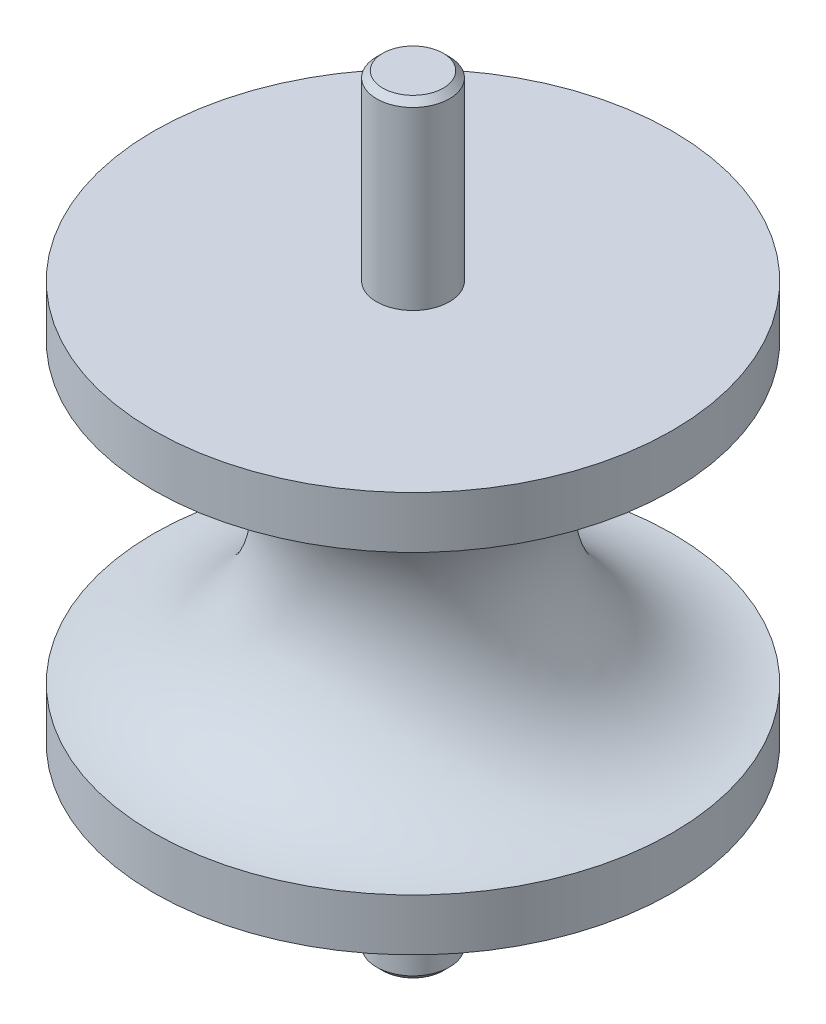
ISO-10303-21;
HEADER;
FILE_DESCRIPTION(('STEP AP214'),'2;1');
FILE_NAME('part.step','',(''),(''),'','','');
FILE_SCHEMA(('AUTOMOTIVE_DESIGN { 1 0 10303 214 1 1 1 1 }'));
ENDSEC;
DATA;
#1=APPLICATION_CONTEXT('core data for automotive mechanical design processes');
#2=APPLICATION_PROTOCOL_DEFINITION('international standard','automotive_design',2000,#1);
#3=PRODUCT_CONTEXT('',#1,'mechanical');
#4=PRODUCT('Part','Part','',(#3));
#5=PRODUCT_RELATED_PRODUCT_CATEGORY('part','',(#4));
#6=PRODUCT_DEFINITION_FORMATION('','',#4);
#7=PRODUCT_DEFINITION_CONTEXT('part definition',#1,'design');
#8=PRODUCT_DEFINITION('design','',#6,#7);
#9=PRODUCT_DEFINITION_SHAPE('','',#8);
#10=(LENGTH_UNIT() NAMED_UNIT(*) SI_UNIT(.MILLI.,.METRE.));
#11=(NAMED_UNIT(*) PLANE_ANGLE_UNIT() SI_UNIT($,.RADIAN.));
#12=(NAMED_UNIT(*) SI_UNIT($,.STERADIAN.) SOLID_ANGLE_UNIT());
#13=UNCERTAINTY_MEASURE_WITH_UNIT(LENGTH_MEASURE(1.E-05),#10,'distance_accuracy_value','');
#14=(GEOMETRIC_REPRESENTATION_CONTEXT(3) GLOBAL_UNCERTAINTY_ASSIGNED_CONTEXT((#13)) GLOBAL_UNIT_ASSIGNED_CONTEXT((#10,
#11,#12)) REPRESENTATION_CONTEXT('',''));
#15=CARTESIAN_POINT('',(0.,0.,0.));
#16=DIRECTION('',(0.,0.,1.));
#17=DIRECTION('',(1.,0.,0.));
#18=AXIS2_PLACEMENT_3D('',#15,#16,#17);
#19=CARTESIAN_POINT('',(28.5,22.,0.));
#20=DIRECTION('',(0.,1.,0.));
#21=DIRECTION('',(0.,0.,1.));
#22=AXIS2_PLACEMENT_3D('',#19,#20,#21);
#23=PLANE('',#22);
#24=CARTESIAN_POINT('',(0.,22.,0.));
#25=DIRECTION('',(0.,-1.,0.));
#26=DIRECTION('',(0.,0.,-1.));
#27=AXIS2_PLACEMENT_3D('',#24,#25,#26);
#28=CIRCLE('',#27,4.);
#29=CARTESIAN_POINT('',(0.,22.,-4.));
#30=VERTEX_POINT('',#29);
#31=EDGE_CURVE('E9',#30,#30,#28,.T.);
#32=ORIENTED_EDGE('',*,*,#31,.T.);
#33=EDGE_LOOP('',(#32));
#34=FACE_BOUND('',#33,.T.);
#35=CARTESIAN_POINT('',(0.,22.,0.));
#36=DIRECTION('',(0.,-1.,0.));
#37=DIRECTION('',(0.,0.,-1.));
#38=AXIS2_PLACEMENT_3D('',#35,#36,#37);
#39=CIRCLE('',#38,28.5);
#40=CARTESIAN_POINT('',(0.,22.,-28.5));
#41=VERTEX_POINT('',#40);
#42=EDGE_CURVE('E63',#41,#41,#39,.T.);
#43=ORIENTED_EDGE('',*,*,#42,.F.);
#44=EDGE_LOOP('',(#43));
#45=FACE_BOUND('',#44,.T.);
#46=ADVANCED_FACE('F13',(#34,#45),#23,.T.);
#47=CARTESIAN_POINT('',(0.,42.,0.));
#48=DIRECTION('',(0.,-1.,0.));
#49=DIRECTION('',(0.,0.,-1.));
#50=AXIS2_PLACEMENT_3D('',#47,#48,#49);
#51=CYLINDRICAL_SURFACE('',#50,4.);
#52=CARTESIAN_POINT('',(0.,41.3234375,0.));
#53=DIRECTION('',(0.,-1.,0.));
#54=DIRECTION('',(0.,0.,-1.));
#55=AXIS2_PLACEMENT_3D('',#52,#53,#54);
#56=CIRCLE('',#55,4.);
#57=CARTESIAN_POINT('',(0.,41.3234375,-4.));
#58=VERTEX_POINT('',#57);
#59=EDGE_CURVE('E20',#58,#58,#56,.T.);
#60=ORIENTED_EDGE('',*,*,#59,.T.);
#61=EDGE_LOOP('',(#60));
#62=FACE_BOUND('',#61,.T.);
#63=ORIENTED_EDGE('',*,*,#31,.F.);
#64=EDGE_LOOP('',(#63));
#65=FACE_BOUND('',#64,.T.);
#66=ADVANCED_FACE('F71',(#62,#65),#51,.T.);
#67=CARTESIAN_POINT('',(0.,41.3234375,0.));
#68=DIRECTION('',(0.,-1.,0.));
#69=DIRECTION('',(0.,0.,-1.));
#70=AXIS2_PLACEMENT_3D('',#67,#68,#69);
#71=CONICAL_SURFACE('',#70,4.,0.785398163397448);
#72=CARTESIAN_POINT('',(0.,42.,0.));
#73=DIRECTION('',(0.,-1.,0.));
#74=DIRECTION('',(0.,0.,-1.));
#75=AXIS2_PLACEMENT_3D('',#72,#73,#74);
#76=CIRCLE('',#75,3.3234375);
#77=CARTESIAN_POINT('',(0.,42.,-3.3234375));
#78=VERTEX_POINT('',#77);
#79=EDGE_CURVE('E29',#78,#78,#76,.T.);
#80=ORIENTED_EDGE('',*,*,#79,.T.);
#81=EDGE_LOOP('',(#80));
#82=FACE_BOUND('',#81,.T.);
#83=ORIENTED_EDGE('',*,*,#59,.F.);
#84=EDGE_LOOP('',(#83));
#85=FACE_BOUND('',#84,.T.);
#86=ADVANCED_FACE('F77',(#82,#85),#71,.T.);
#87=CARTESIAN_POINT('',(0.,42.,0.));
#88=DIRECTION('',(0.,-1.,0.));
#89=DIRECTION('',(0.,0.,-1.));
#90=AXIS2_PLACEMENT_3D('',#87,#88,#89);
#91=PLANE('',#90);
#92=ORIENTED_EDGE('',*,*,#79,.F.);
#93=EDGE_LOOP('',(#92));
#94=FACE_BOUND('',#93,.T.);
#95=ADVANCED_FACE('F82',(#94),#91,.F.);
#96=CARTESIAN_POINT('',(0.,-42.,0.));
#97=DIRECTION('',(0.,-1.,0.));
#98=DIRECTION('',(0.,0.,-1.));
#99=AXIS2_PLACEMENT_3D('',#96,#97,#98);
#100=PLANE('',#99);
#101=CARTESIAN_POINT('',(0.,-42.,0.));
#102=DIRECTION('',(0.,-1.,0.));
#103=DIRECTION('',(0.,0.,-1.));
#104=AXIS2_PLACEMENT_3D('',#101,#102,#103);
#105=CIRCLE('',#104,3.32343750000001);
#106=CARTESIAN_POINT('',(0.,-42.,-3.32343750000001));
#107=VERTEX_POINT('',#106);
#108=EDGE_CURVE('E37',#107,#107,#105,.T.);
#109=ORIENTED_EDGE('',*,*,#108,.T.);
#110=EDGE_LOOP('',(#109));
#111=FACE_BOUND('',#110,.T.);
#112=ADVANCED_FACE('F89',(#111),#100,.T.);
#113=CARTESIAN_POINT('',(0.,-41.3234375,0.));
#114=DIRECTION('',(0.,1.,0.));
#115=DIRECTION('',(0.,0.,1.));
#116=AXIS2_PLACEMENT_3D('',#113,#114,#115);
#117=CONICAL_SURFACE('',#116,4.,0.785398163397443);
#118=ORIENTED_EDGE('',*,*,#108,.F.);
#119=EDGE_LOOP('',(#118));
#120=FACE_BOUND('',#119,.T.);
#121=CARTESIAN_POINT('',(0.,-41.3234375,0.));
#122=DIRECTION('',(0.,-1.,0.));
#123=DIRECTION('',(0.,0.,-1.));
#124=AXIS2_PLACEMENT_3D('',#121,#122,#123);
#125=CIRCLE('',#124,4.);
#126=CARTESIAN_POINT('',(0.,-41.3234375,-4.));
#127=VERTEX_POINT('',#126);
#128=EDGE_CURVE('E43',#127,#127,#125,.T.);
#129=ORIENTED_EDGE('',*,*,#128,.T.);
#130=EDGE_LOOP('',(#129));
#131=FACE_BOUND('',#130,.T.);
#132=ADVANCED_FACE('F93',(#120,#131),#117,.T.);
#133=CARTESIAN_POINT('',(0.,42.,0.));
#134=DIRECTION('',(0.,-1.,0.));
#135=DIRECTION('',(0.,0.,-1.));
#136=AXIS2_PLACEMENT_3D('',#133,#134,#135);
#137=CYLINDRICAL_SURFACE('',#136,4.);
#138=ORIENTED_EDGE('',*,*,#128,.F.);
#139=EDGE_LOOP('',(#138));
#140=FACE_BOUND('',#139,.T.);
#141=CARTESIAN_POINT('',(0.,-22.,0.));
#142=DIRECTION('',(0.,-1.,0.));
#143=DIRECTION('',(0.,0.,-1.));
#144=AXIS2_PLACEMENT_3D('',#141,#142,#143);
#145=CIRCLE('',#144,4.);
#146=CARTESIAN_POINT('',(0.,-22.,-4.));
#147=VERTEX_POINT('',#146);
#148=EDGE_CURVE('E47',#147,#147,#145,.T.);
#149=ORIENTED_EDGE('',*,*,#148,.T.);
#150=EDGE_LOOP('',(#149));
#151=FACE_BOUND('',#150,.T.);
#152=ADVANCED_FACE('F97',(#140,#151),#137,.T.);
#153=CARTESIAN_POINT('',(28.5,-22.,0.));
#154=DIRECTION('',(0.,1.,0.));
#155=DIRECTION('',(0.,0.,1.));
#156=AXIS2_PLACEMENT_3D('',#153,#154,#155);
#157=PLANE('',#156);
#158=ORIENTED_EDGE('',*,*,#148,.F.);
#159=EDGE_LOOP('',(#158));
#160=FACE_BOUND('',#159,.T.);
#161=CARTESIAN_POINT('',(0.,-22.,0.));
#162=DIRECTION('',(0.,-1.,0.));
#163=DIRECTION('',(0.,0.,-1.));
#164=AXIS2_PLACEMENT_3D('',#161,#162,#163);
#165=CIRCLE('',#164,28.5);
#166=CARTESIAN_POINT('',(0.,-22.,-28.5));
#167=VERTEX_POINT('',#166);
#168=EDGE_CURVE('E51',#167,#167,#165,.T.);
#169=ORIENTED_EDGE('',*,*,#168,.T.);
#170=EDGE_LOOP('',(#169));
#171=FACE_BOUND('',#170,.T.);
#172=ADVANCED_FACE('F101',(#160,#171),#157,.F.);
#173=CARTESIAN_POINT('',(0.,42.,0.));
#174=DIRECTION('',(0.,-1.,0.));
#175=DIRECTION('',(0.,0.,-1.));
#176=AXIS2_PLACEMENT_3D('',#173,#174,#175);
#177=CYLINDRICAL_SURFACE('',#176,28.5);
#178=CARTESIAN_POINT('',(0.,-16.3,0.));
#179=DIRECTION('',(0.,-1.,0.));
#180=DIRECTION('',(0.,0.,-1.));
#181=AXIS2_PLACEMENT_3D('',#178,#179,#180);
#182=CIRCLE('',#181,28.5);
#183=CARTESIAN_POINT('',(0.,-16.3,-28.5));
#184=VERTEX_POINT('',#183);
#185=EDGE_CURVE('E55',#184,#184,#182,.T.);
#186=ORIENTED_EDGE('',*,*,#185,.T.);
#187=EDGE_LOOP('',(#186));
#188=FACE_BOUND('',#187,.T.);
#189=ORIENTED_EDGE('',*,*,#168,.F.);
#190=EDGE_LOOP('',(#189));
#191=FACE_BOUND('',#190,.T.);
#192=ADVANCED_FACE('F105',(#188,#191),#177,.T.);
#193=CARTESIAN_POINT('',(0.,0.,0.));
#194=DIRECTION('',(0.,-1.,0.));
#195=DIRECTION('',(0.,0.,-1.));
#196=AXIS2_PLACEMENT_3D('',#193,#194,#195);
#197=TOROIDAL_SURFACE('',#196,28.9211011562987,16.3054385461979);
#198=ORIENTED_EDGE('',*,*,#185,.F.);
#199=EDGE_LOOP('',(#198));
#200=FACE_BOUND('',#199,.T.);
#201=CARTESIAN_POINT('',(0.,16.3,0.));
#202=DIRECTION('',(0.,-1.,0.));
#203=DIRECTION('',(0.,0.,-1.));
#204=AXIS2_PLACEMENT_3D('',#201,#202,#203);
#205=CIRCLE('',#204,28.5);
#206=CARTESIAN_POINT('',(0.,16.3,-28.5));
#207=VERTEX_POINT('',#206);
#208=EDGE_CURVE('E59',#207,#207,#205,.T.);
#209=ORIENTED_EDGE('',*,*,#208,.T.);
#210=EDGE_LOOP('',(#209));
#211=FACE_BOUND('',#210,.T.);
#212=ADVANCED_FACE('F109',(#200,#211),#197,.F.);
#213=CARTESIAN_POINT('',(0.,42.,0.));
#214=DIRECTION('',(0.,-1.,0.));
#215=DIRECTION('',(0.,0.,-1.));
#216=AXIS2_PLACEMENT_3D('',#213,#214,#215);
#217=CYLINDRICAL_SURFACE('',#216,28.5);
#218=ORIENTED_EDGE('',*,*,#208,.F.);
#219=EDGE_LOOP('',(#218));
#220=FACE_BOUND('',#219,.T.);
#221=ORIENTED_EDGE('',*,*,#42,.T.);
#222=EDGE_LOOP('',(#221));
#223=FACE_BOUND('',#222,.T.);
#224=ADVANCED_FACE('F68',(#220,#223),#217,.T.);
#225=CLOSED_SHELL('',(#46,#66,#86,#95,#112,#132,#152,#172,#192,#212,#224));
#226=MANIFOLD_SOLID_BREP('B1',#225);
#227=ADVANCED_BREP_SHAPE_REPRESENTATION('',(#18,#226),#14);
#228=SHAPE_DEFINITION_REPRESENTATION(#9,#227);
ENDSEC;
END-ISO-10303-21;
